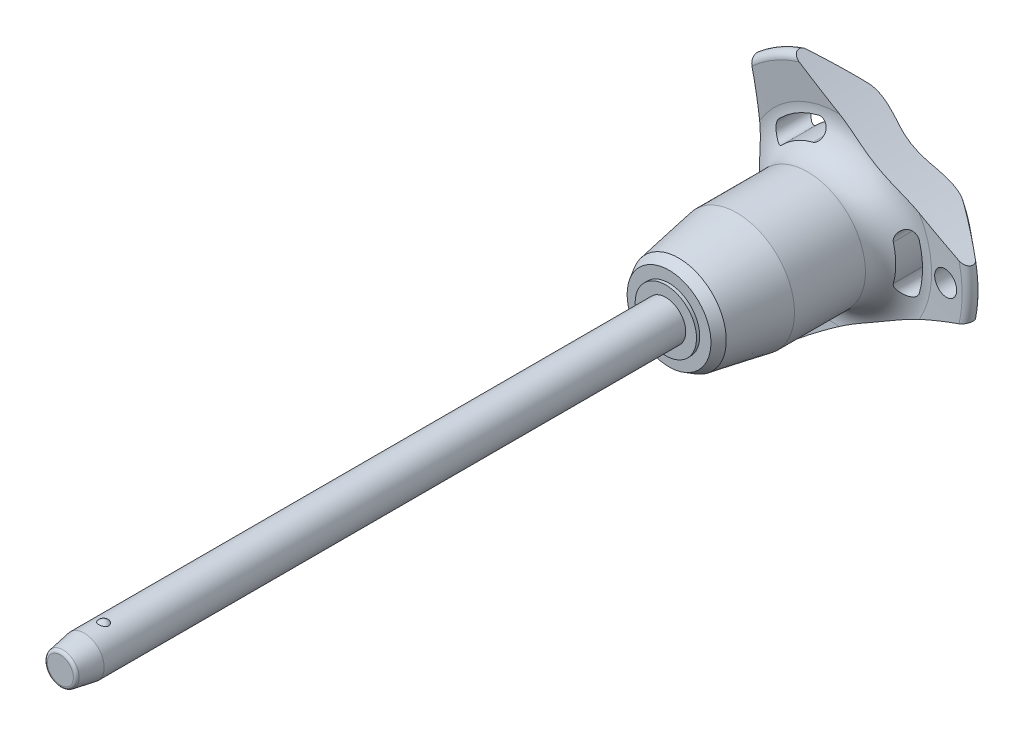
from build123d import *

# Parameters (mm, degrees)
SKETCH1_R           = 2.5
BOSS_EXTRUDE1_DEPTH = 70
SKETCH2_R           = 2.1
BOSS_EXTRUDE2_DEPTH = 26.7
BOSS_EXTRUDE3_START = 6
SKETCH1_2_R         = 2.5
BOSS_EXTRUDE3_DEPTH = 6
CHAMFER1_SIZE       = 3
CHAMFER1_SIZE2      = 0.528980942
FILLET1_R           = 0.4
SKETCH6_R           = 79.96
CUT_EXTRUDE1_DEPTH  = 100.509565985
CIRPATTERN1_COUNT   = 3
SKETCH7_R           = 1.5
CUT_EXTRUDE2_DEPTH  = 100.35648861


with BuildPart() as part:
    # Sketch1 → Boss-Extrude1 (new body)
    with BuildSketch(Plane.XY):
        Circle(SKETCH1_R)
    extrude(amount=-BOSS_EXTRUDE1_DEPTH)

    # Sketch2 → Boss-Extrude2 (add)
    with BuildSketch(Plane(origin=(0, 0, -70), x_dir=(-1, 0, 0), z_dir=(0, 0, -1))):
        Circle(SKETCH2_R)
    extrude(amount=BOSS_EXTRUDE2_DEPTH)

    # Sketch3 → Revolve1 (revolve)
    with BuildSketch(Plane(origin=(0, 0, 0), x_dir=(0, 0, -1), z_dir=(1, 0, 0))):
        with BuildLine():
            Line((-0.580947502, 2.75), (-0.580947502, 1.15))
            ThreePointArc((-0.580947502, 1.15), (0.219052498, 1.95), (-0.580947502, 2.75))
        make_face()
        with BuildLine():
            Line((-0.580947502, -1.15), (-0.580947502, -2.75))
            ThreePointArc((-0.580947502, -2.75), (0.219052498, -1.95), (-0.580947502, -1.15))
        make_face()
    revolve(axis=Axis((0, -1.15, 0.580947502), (0, 1, 0)))

    # Sketch1_2 → Boss-Extrude3 (add)
    with BuildSketch(Plane.XY.offset(BOSS_EXTRUDE3_START)):
        Circle(SKETCH1_2_R)
    extrude(amount=-BOSS_EXTRUDE3_DEPTH)

    # Chamfer1
    chamfer1_edges = [part.edges().sort_by_distance(p)[0] for p in [
        (-2.5, 0, 6),
    ]]
    chamfer1_side = [part.faces().sort_by_distance(p)[0] for p in [
        (-2.5, 0, -32),
    ]]
    chamfer(chamfer1_edges, length=CHAMFER1_SIZE, length2=CHAMFER1_SIZE2, reference=chamfer1_side[0])

    # Fillet1
    fillet1_edges = [part.edges().sort_by_distance(p)[0] for p in [
        (-1.971019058, 0, 6),
        (2.1, 0, -96.7),
    ]]
    fillet(fillet1_edges, radius=FILLET1_R)

    # Sketch4 → Revolve2 (revolve)
    with BuildSketch(Plane(origin=(0, 0, 0), x_dir=(0, 0, -1), z_dir=(1, 0, 0)), mode=Mode.PRIVATE) as revolve2_sk:
        Polygon((70, 0), (70, 3.851837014), (70.4, 3.851837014), (70.4, 5.26161122), (71.620900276, 5.966498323), (78.9, 7.25), (87.8, 7.25), (87.8, 0), align=None)
    revolve(revolve2_sk.sketch.rotate(Axis((0, 0, -87.8), (0, 0, 1)), 90), axis=Axis((0, 0, -87.8), (0, 0, 1)))

    # Sketch5 → Revolve3 (revolve)
    with BuildSketch(Plane(origin=(0, 0, 0), x_dir=(0, 0, -1), z_dir=(1, 0, 0)), mode=Mode.PRIVATE) as revolve3_sk:
        with BuildLine():
            Line((91.78715932, 11.570250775), (91.452568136, 15.735949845))
            ThreePointArc((91.452568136, 15.735949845), (91.946485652, 16.540188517), (92.862835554, 16.314230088))
            Line((92.862835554, 16.314230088), (96.326414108, 12.186497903))
            ThreePointArc((96.326414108, 12.186497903), (96.7, 11.109282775), (96.261488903, 10.056825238))
            ThreePointArc((96.261488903, 10.056825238), (93.289873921, 5.413681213), (92.25, 0))
            Line((92.25, 0), (87.8, 0))
            Line((87.8, 0), (87.8, 7.25))
            ThreePointArc((87.8, 7.25), (90.739473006, 8.537160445), (91.78715932, 11.570250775))
        make_face()
    revolve(revolve3_sk.sketch.rotate(Axis((0, 0, -92.25), (0, 0, 1)), 90), axis=Axis((0, 0, -92.25), (0, 0, 1)))

    # Sketch6 → Cut-Extrude1 (cut, through all)
    with BuildSketch(Plane.XY):
        with Locations((-89.76, 0)):
            Circle(SKETCH6_R)
        with BuildLine():
            ThreePointArc((10.099921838, -2.834717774), (10.490188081, 0), (10.099921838, 2.834717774))
            ThreePointArc((10.099921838, 2.834717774), (8.768180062, 3.582738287), (8.020159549, 2.250996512))
            ThreePointArc((8.020159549, 2.250996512), (8.330062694, 0), (8.020159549, -2.250996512))
            ThreePointArc((8.020159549, -2.250996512), (8.768180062, -3.582738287), (10.099921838, -2.834717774))
        make_face()
    cut_extrude1 = extrude(amount=-CUT_EXTRUDE1_DEPTH, mode=Mode.SUBTRACT)

    # CirPattern1: Cut-Extrude1 ×3 about axis
    cirpattern1_axis = Axis((0, 0, 0), (0, 0, 1))
    for i in range(1, CIRPATTERN1_COUNT):
        add(cut_extrude1.rotate(cirpattern1_axis, i * 360 / CIRPATTERN1_COUNT), mode=Mode.SUBTRACT)

    # Sketch7 → Cut-Extrude2 (cut, through all)
    with BuildSketch(Plane.XY):
        with Locations(Location((13.490188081, 0, 0), (0, 0, 225.221865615))):
            Circle(SKETCH7_R)
    extrude(amount=-CUT_EXTRUDE2_DEPTH, mode=Mode.SUBTRACT)


solid = part.part
